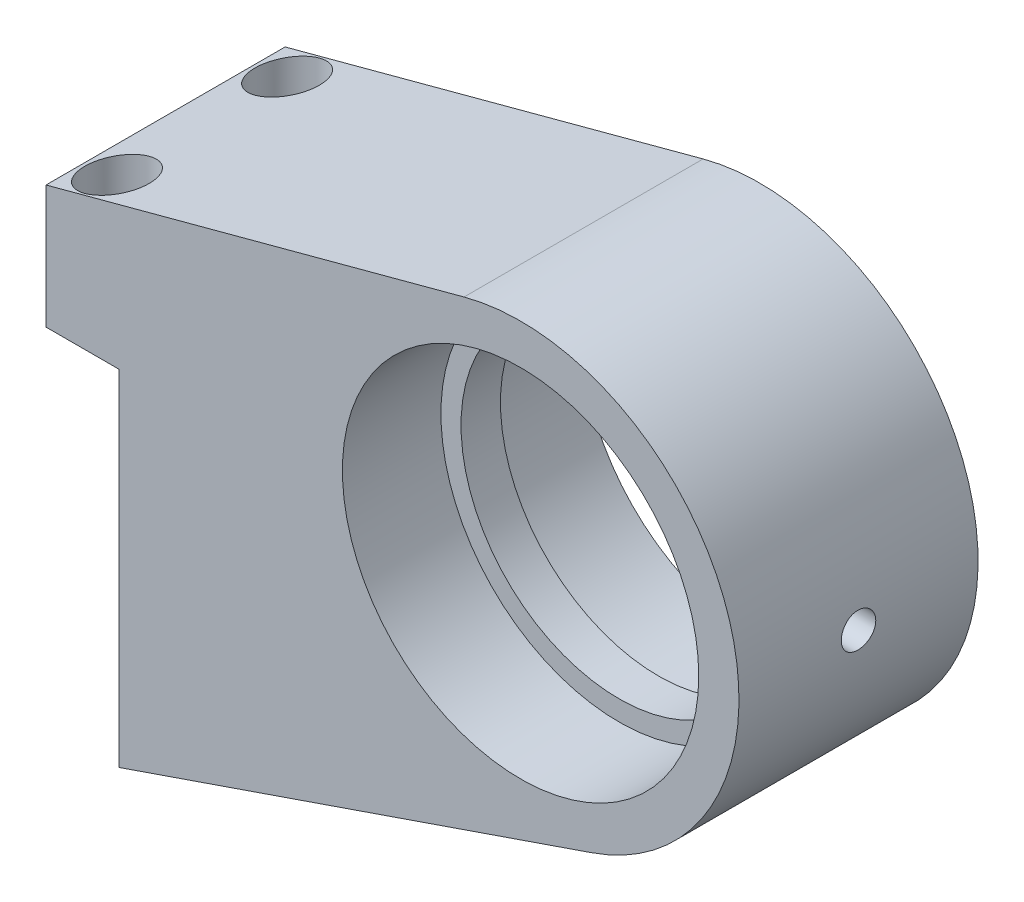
ISO-10303-21;
HEADER;
FILE_DESCRIPTION(('STEP AP214'),'2;1');
FILE_NAME('part.step','',(''),(''),'','','');
FILE_SCHEMA(('AUTOMOTIVE_DESIGN { 1 0 10303 214 1 1 1 1 }'));
ENDSEC;
DATA;
#1=APPLICATION_CONTEXT('core data for automotive mechanical design processes');
#2=APPLICATION_PROTOCOL_DEFINITION('international standard','automotive_design',2000,#1);
#3=PRODUCT_CONTEXT('',#1,'mechanical');
#4=PRODUCT('Part','Part','',(#3));
#5=PRODUCT_RELATED_PRODUCT_CATEGORY('part','',(#4));
#6=PRODUCT_DEFINITION_FORMATION('','',#4);
#7=PRODUCT_DEFINITION_CONTEXT('part definition',#1,'design');
#8=PRODUCT_DEFINITION('design','',#6,#7);
#9=PRODUCT_DEFINITION_SHAPE('','',#8);
#10=(LENGTH_UNIT() NAMED_UNIT(*) SI_UNIT(.MILLI.,.METRE.));
#11=(NAMED_UNIT(*) PLANE_ANGLE_UNIT() SI_UNIT($,.RADIAN.));
#12=(NAMED_UNIT(*) SI_UNIT($,.STERADIAN.) SOLID_ANGLE_UNIT());
#13=UNCERTAINTY_MEASURE_WITH_UNIT(LENGTH_MEASURE(1.E-05),#10,'distance_accuracy_value','');
#14=(GEOMETRIC_REPRESENTATION_CONTEXT(3) GLOBAL_UNCERTAINTY_ASSIGNED_CONTEXT((#13)) GLOBAL_UNIT_ASSIGNED_CONTEXT((#10,
#11,#12)) REPRESENTATION_CONTEXT('',''));
#15=CARTESIAN_POINT('',(0.,0.,0.));
#16=DIRECTION('',(0.,0.,1.));
#17=DIRECTION('',(1.,0.,0.));
#18=AXIS2_PLACEMENT_3D('',#15,#16,#17);
#19=CARTESIAN_POINT('',(-210.619690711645,105.906843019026,41.6));
#20=DIRECTION('',(1.,0.,0.));
#21=DIRECTION('',(0.,0.,-1.));
#22=AXIS2_PLACEMENT_3D('',#19,#20,#21);
#23=PLANE('',#22);
#24=DIRECTION('',(0.,1.,0.));
#25=VECTOR('',#24,1.);
#26=CARTESIAN_POINT('',(-210.619690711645,105.906843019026,0.));
#27=LINE('',#26,#25);
#28=CARTESIAN_POINT('',(-210.619690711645,105.906843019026,0.));
#29=VERTEX_POINT('',#28);
#30=CARTESIAN_POINT('',(-210.619690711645,127.324395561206,0.));
#31=VERTEX_POINT('',#30);
#32=EDGE_CURVE('E60',#29,#31,#27,.T.);
#33=ORIENTED_EDGE('',*,*,#32,.F.);
#34=DIRECTION('',(0.,0.,-1.));
#35=VECTOR('',#34,1.);
#36=CARTESIAN_POINT('',(-210.619690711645,105.906843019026,26.5));
#37=LINE('',#36,#35);
#38=CARTESIAN_POINT('',(-210.619690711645,105.906843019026,41.6));
#39=VERTEX_POINT('',#38);
#40=EDGE_CURVE('E106',#39,#29,#37,.T.);
#41=ORIENTED_EDGE('',*,*,#40,.F.);
#42=DIRECTION('',(0.,-1.,0.));
#43=VECTOR('',#42,1.);
#44=CARTESIAN_POINT('',(-210.619690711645,105.906843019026,41.6));
#45=LINE('',#44,#43);
#46=CARTESIAN_POINT('',(-210.619690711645,127.324395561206,41.6));
#47=VERTEX_POINT('',#46);
#48=EDGE_CURVE('E620',#47,#39,#45,.T.);
#49=ORIENTED_EDGE('',*,*,#48,.F.);
#50=DIRECTION('',(0.,0.,1.));
#51=VECTOR('',#50,1.);
#52=CARTESIAN_POINT('',(-210.619690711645,127.324395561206,41.6));
#53=LINE('',#52,#51);
#54=EDGE_CURVE('E52',#47,#31,#53,.F.);
#55=ORIENTED_EDGE('',*,*,#54,.T.);
#56=EDGE_LOOP('',(#33,#41,#49,#55));
#57=FACE_BOUND('',#56,.T.);
#58=ADVANCED_FACE('F41',(#57),#23,.F.);
#59=CARTESIAN_POINT('',(-197.919690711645,45.9068430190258,41.6));
#60=DIRECTION('',(-0.325094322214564,0.945681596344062,0.));
#61=DIRECTION('',(-0.945681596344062,-0.325094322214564,0.));
#62=AXIS2_PLACEMENT_3D('',#59,#60,#61);
#63=PLANE('',#62);
#64=DIRECTION('',(0.,0.,-1.));
#65=VECTOR('',#64,1.);
#66=CARTESIAN_POINT('',(-115.696768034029,74.1723875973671,41.6));
#67=LINE('',#66,#65);
#68=CARTESIAN_POINT('',(-115.696768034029,74.1723875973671,41.6));
#69=VERTEX_POINT('',#68);
#70=CARTESIAN_POINT('',(-115.696768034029,74.1723875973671,0.));
#71=VERTEX_POINT('',#70);
#72=EDGE_CURVE('E114',#69,#71,#67,.T.);
#73=ORIENTED_EDGE('',*,*,#72,.F.);
#74=DIRECTION('',(0.945681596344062,0.325094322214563,0.));
#75=VECTOR('',#74,1.);
#76=CARTESIAN_POINT('',(-115.696768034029,74.1723875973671,41.6));
#77=LINE('',#76,#75);
#78=CARTESIAN_POINT('',(-197.919690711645,45.9068430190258,41.6));
#79=VERTEX_POINT('',#78);
#80=EDGE_CURVE('E525',#79,#69,#77,.T.);
#81=ORIENTED_EDGE('',*,*,#80,.F.);
#82=DIRECTION('',(0.,0.,-1.));
#83=VECTOR('',#82,1.);
#84=CARTESIAN_POINT('',(-197.919690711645,45.9068430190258,41.6));
#85=LINE('',#84,#83);
#86=CARTESIAN_POINT('',(-197.919690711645,45.9068430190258,26.5));
#87=VERTEX_POINT('',#86);
#88=EDGE_CURVE('E523',#79,#87,#85,.T.);
#89=ORIENTED_EDGE('',*,*,#88,.T.);
#90=CARTESIAN_POINT('',(-197.919690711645,45.9068430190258,23.5));
#91=DIRECTION('',(-0.325094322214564,0.945681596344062,0.));
#92=DIRECTION('',(-0.945681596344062,-0.325094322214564,0.));
#93=AXIS2_PLACEMENT_3D('',#90,#91,#92);
#94=ELLIPSE('',#93,9.22809103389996,3.);
#95=CARTESIAN_POINT('',(-189.70036271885,48.7323784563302,24.5081416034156));
#96=VERTEX_POINT('',#95);
#97=EDGE_CURVE('E170',#96,#87,#94,.F.);
#98=ORIENTED_EDGE('',*,*,#97,.F.);
#99=CARTESIAN_POINT('',(-176.00148273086,53.4416041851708,26.1883776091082));
#100=DIRECTION('',(-0.325094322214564,0.945681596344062,0.));
#101=DIRECTION('',(-0.945681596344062,-0.325094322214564,0.));
#102=AXIS2_PLACEMENT_3D('',#99,#100,#101);
#103=ELLIPSE('',#102,15.3801517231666,5.);
#104=CARTESIAN_POINT('',(-179.654517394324,52.1858106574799,21.3486480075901));
#105=VERTEX_POINT('',#104);
#106=EDGE_CURVE('E166',#105,#96,#103,.T.);
#107=ORIENTED_EDGE('',*,*,#106,.F.);
#108=CARTESIAN_POINT('',(-197.919690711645,45.9068430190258,-2.84999999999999));
#109=DIRECTION('',(-0.325094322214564,0.945681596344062,0.));
#110=DIRECTION('',(-0.945681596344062,-0.325094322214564,0.));
#111=AXIS2_PLACEMENT_3D('',#108,#109,#110);
#112=ELLIPSE('',#111,76.900758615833,25.);
#113=CARTESIAN_POINT('',(-125.670162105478,70.7438617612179,0.));
#114=VERTEX_POINT('',#113);
#115=EDGE_CURVE('E171',#114,#105,#112,.F.);
#116=ORIENTED_EDGE('',*,*,#115,.F.);
#117=DIRECTION('',(-0.945681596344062,-0.325094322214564,0.));
#118=VECTOR('',#117,1.);
#119=CARTESIAN_POINT('',(-197.919690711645,45.9068430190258,0.));
#120=LINE('',#119,#118);
#121=EDGE_CURVE('E135',#71,#114,#120,.T.);
#122=ORIENTED_EDGE('',*,*,#121,.F.);
#123=EDGE_LOOP('',(#73,#81,#89,#98,#107,#116,#122));
#124=FACE_BOUND('',#123,.T.);
#125=ADVANCED_FACE('F356',(#124),#63,.F.);
#126=CARTESIAN_POINT('',(-128.050352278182,110.108288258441,41.6));
#127=DIRECTION('',(0.,0.,-1.));
#128=DIRECTION('',(-1.,0.,0.));
#129=AXIS2_PLACEMENT_3D('',#126,#127,#128);
#130=CYLINDRICAL_SURFACE('',#129,38.);
#131=CARTESIAN_POINT('',(-90.0503676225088,110.074139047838,17.8));
#132=CARTESIAN_POINT('',(-90.0502180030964,110.242361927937,17.8000073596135));
#133=CARTESIAN_POINT('',(-90.0511941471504,110.41070106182,17.8141970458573));
#134=CARTESIAN_POINT('',(-90.0552848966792,110.742725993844,17.8705958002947));
#135=CARTESIAN_POINT('',(-90.0584019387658,110.906406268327,17.9128367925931));
#136=CARTESIAN_POINT('',(-90.0664099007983,111.224256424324,18.0241117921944));
#137=CARTESIAN_POINT('',(-90.0712998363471,111.378431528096,18.0931309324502));
#138=CARTESIAN_POINT('',(-90.0822931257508,111.672971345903,18.2559770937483));
#139=CARTESIAN_POINT('',(-90.0883962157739,111.813339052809,18.3497987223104));
#140=CARTESIAN_POINT('',(-90.1011356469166,112.076636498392,18.5598174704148));
#141=CARTESIAN_POINT('',(-90.1077730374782,112.199530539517,18.6760592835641));
#142=CARTESIAN_POINT('',(-90.1208154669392,112.424086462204,18.9275246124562));
#143=CARTESIAN_POINT('',(-90.127220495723,112.525747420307,19.0627489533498));
#144=CARTESIAN_POINT('',(-90.1390766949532,112.705074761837,19.3485607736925));
#145=CARTESIAN_POINT('',(-90.1445265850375,112.782709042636,19.4991684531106));
#146=CARTESIAN_POINT('',(-90.1538381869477,112.91157532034,19.8113306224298));
#147=CARTESIAN_POINT('',(-90.157699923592,112.962807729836,19.9728849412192));
#148=CARTESIAN_POINT('',(-90.1633860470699,113.037315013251,20.3020058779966));
#149=CARTESIAN_POINT('',(-90.1652145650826,113.060646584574,20.4695595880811));
#150=CARTESIAN_POINT('',(-90.1666385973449,113.078864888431,20.8062142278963));
#151=CARTESIAN_POINT('',(-90.1662341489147,113.073752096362,20.9753151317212));
#152=CARTESIAN_POINT('',(-90.1632421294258,113.035274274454,21.309871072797));
#153=CARTESIAN_POINT('',(-90.1606593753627,113.001971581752,21.4753333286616));
#154=CARTESIAN_POINT('',(-90.1536118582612,112.908156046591,21.7983123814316));
#155=CARTESIAN_POINT('',(-90.1491470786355,112.847642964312,21.9558291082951));
#156=CARTESIAN_POINT('',(-90.1388376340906,112.701054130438,22.2586449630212));
#157=CARTESIAN_POINT('',(-90.1329914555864,112.614950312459,22.4039304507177));
#158=CARTESIAN_POINT('',(-90.1205859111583,112.419644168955,22.6780104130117));
#159=CARTESIAN_POINT('',(-90.1140265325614,112.310441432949,22.8068045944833));
#160=CARTESIAN_POINT('',(-90.100920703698,112.071688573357,23.0446067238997));
#161=CARTESIAN_POINT('',(-90.094374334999,111.942084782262,23.1535608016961));
#162=CARTESIAN_POINT('',(-90.0820588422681,111.666396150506,23.3481732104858));
#163=CARTESIAN_POINT('',(-90.0762897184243,111.520311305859,23.4338315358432));
#164=CARTESIAN_POINT('',(-90.0661891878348,111.215780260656,23.5794134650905));
#165=CARTESIAN_POINT('',(-90.0618578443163,111.057333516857,23.6393359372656));
#166=CARTESIAN_POINT('',(-90.0551340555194,110.732586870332,23.7317134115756));
#167=CARTESIAN_POINT('',(-90.0527415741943,110.566287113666,23.7641689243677));
#168=CARTESIAN_POINT('',(-90.0501818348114,110.231031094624,23.8006233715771));
#169=CARTESIAN_POINT('',(-90.0500086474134,110.062083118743,23.8046981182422));
#170=CARTESIAN_POINT('',(-90.051904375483,109.725907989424,23.784474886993));
#171=CARTESIAN_POINT('',(-90.0539732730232,109.558680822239,23.7601771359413));
#172=CARTESIAN_POINT('',(-90.0601292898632,109.230899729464,23.6839601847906));
#173=CARTESIAN_POINT('',(-90.0642139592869,109.070337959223,23.6320745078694));
#174=CARTESIAN_POINT('',(-90.0739549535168,108.760200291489,23.5021898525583));
#175=CARTESIAN_POINT('',(-90.0796113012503,108.610624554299,23.4241904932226));
#176=CARTESIAN_POINT('',(-90.091888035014,108.326349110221,23.2440956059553));
#177=CARTESIAN_POINT('',(-90.0985104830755,108.191682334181,23.1419482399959));
#178=CARTESIAN_POINT('',(-90.1119778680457,107.941380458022,22.9165320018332));
#179=CARTESIAN_POINT('',(-90.1188228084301,107.825745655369,22.7932627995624));
#180=CARTESIAN_POINT('',(-90.1319901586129,107.616530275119,22.5287720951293));
#181=CARTESIAN_POINT('',(-90.1383113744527,107.522999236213,22.3875113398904));
#182=CARTESIAN_POINT('',(-90.1497064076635,107.360986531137,22.0912429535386));
#183=CARTESIAN_POINT('',(-90.1547802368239,107.292504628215,21.9362354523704));
#184=CARTESIAN_POINT('',(-90.1631045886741,107.182623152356,21.6170606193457));
#185=CARTESIAN_POINT('',(-90.1663572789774,107.141191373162,21.4529044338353));
#186=CARTESIAN_POINT('',(-90.1706816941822,107.086480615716,21.1199384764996));
#187=CARTESIAN_POINT('',(-90.1717534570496,107.073201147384,20.951128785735));
#188=CARTESIAN_POINT('',(-90.1715951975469,107.07517738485,20.6141516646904));
#189=CARTESIAN_POINT('',(-90.1703716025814,107.090353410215,20.4459837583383));
#190=CARTESIAN_POINT('',(-90.1657729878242,107.148643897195,20.1145930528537));
#191=CARTESIAN_POINT('',(-90.1623979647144,107.191758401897,19.9513702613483));
#192=CARTESIAN_POINT('',(-90.1538751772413,107.304682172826,19.6344965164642));
#193=CARTESIAN_POINT('',(-90.1487274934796,107.374490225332,19.4808451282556));
#194=CARTESIAN_POINT('',(-90.1372340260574,107.538810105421,19.1874304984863));
#195=CARTESIAN_POINT('',(-90.1308882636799,107.63332149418,19.0476670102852));
#196=CARTESIAN_POINT('',(-90.1176854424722,107.844663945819,18.7855881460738));
#197=CARTESIAN_POINT('',(-90.1108270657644,107.961553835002,18.6633202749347));
#198=CARTESIAN_POINT('',(-90.097374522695,108.214231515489,18.4400919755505));
#199=CARTESIAN_POINT('',(-90.0907804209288,108.35002389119,18.3391367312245));
#200=CARTESIAN_POINT('',(-90.0785779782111,108.636897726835,18.1612725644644));
#201=CARTESIAN_POINT('',(-90.0729714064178,108.78800587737,18.0844066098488));
#202=CARTESIAN_POINT('',(-90.0633858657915,109.100923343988,17.9572354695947));
#203=CARTESIAN_POINT('',(-90.0594050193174,109.262720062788,17.9068996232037));
#204=CARTESIAN_POINT('',(-90.0545492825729,109.53358928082,17.8470965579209));
#205=CARTESIAN_POINT('',(-90.0530731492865,109.640917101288,17.8294587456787));
#206=CARTESIAN_POINT('',(-90.0510306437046,109.856860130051,17.8059081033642));
#207=CARTESIAN_POINT('',(-90.0504642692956,109.965475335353,17.7999952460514));
#208=CARTESIAN_POINT('',(-90.0503676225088,110.074139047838,17.8));
#209=B_SPLINE_CURVE_WITH_KNOTS('',3,(#131,#132,#133,#134,#135,#136,#137,#138,#139,#140,#141,
#142,#143,#144,#145,#146,#147,#148,#149,#150,#151,#152,#153,#154,#155,#156,#157,#158,#159,#160,
#161,#162,#163,#164,#165,#166,#167,#168,#169,#170,#171,#172,#173,#174,#175,#176,#177,#178,#179,
#180,#181,#182,#183,#184,#185,#186,#187,#188,#189,#190,#191,#192,#193,#194,#195,#196,#197,#198,
#199,#200,#201,#202,#203,#204,#205,#206,#207,#208),.UNSPECIFIED.,.T.,.F.,(4,2,2,2,2,2,2,2,2,2,2,
2,2,2,2,2,2,2,2,2,2,2,2,2,2,2,2,2,2,2,2,2,2,2,2,2,2,2,4),(0.,0.504272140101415,1.00911915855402,
1.51368628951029,2.01814380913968,2.5236175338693,3.02911323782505,3.53528145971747,
4.04144177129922,4.54657175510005,5.05169329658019,5.55570075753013,6.05971266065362,
6.56427938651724,7.06885507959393,7.57478101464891,8.08070707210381,8.58665537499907,
9.09259427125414,9.59718115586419,10.1017640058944,10.6057351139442,11.1097135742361,
11.6147838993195,12.1198621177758,12.6260617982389,13.1322566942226,13.6378478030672,
14.1434301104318,14.6475988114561,15.1517682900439,15.6559148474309,16.1600524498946,
16.6655339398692,17.1711382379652,17.6776393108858,18.1835537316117,18.5092895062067,
18.8350245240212),.UNSPECIFIED.);
#210=CARTESIAN_POINT('',(-90.0503676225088,110.074139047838,17.8));
#211=VERTEX_POINT('',#210);
#212=EDGE_CURVE('E362',#211,#211,#209,.T.);
#213=ORIENTED_EDGE('',*,*,#212,.F.);
#214=EDGE_LOOP('',(#213));
#215=FACE_BOUND('',#214,.T.);
#216=DIRECTION('',(0.,0.,1.));
#217=VECTOR('',#216,1.);
#218=CARTESIAN_POINT('',(-137.885475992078,146.813469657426,41.6));
#219=LINE('',#218,#217);
#220=CARTESIAN_POINT('',(-137.885475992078,146.813469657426,0.));
#221=VERTEX_POINT('',#220);
#222=CARTESIAN_POINT('',(-137.885475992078,146.813469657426,41.6));
#223=VERTEX_POINT('',#222);
#224=EDGE_CURVE('E225',#221,#223,#219,.T.);
#225=ORIENTED_EDGE('',*,*,#224,.T.);
#226=CARTESIAN_POINT('',(-128.050352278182,110.108288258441,41.6));
#227=DIRECTION('',(0.,0.,1.));
#228=DIRECTION('',(-1.,0.,0.));
#229=AXIS2_PLACEMENT_3D('',#226,#227,#228);
#230=CIRCLE('',#229,38.);
#231=EDGE_CURVE('E614',#69,#223,#230,.T.);
#232=ORIENTED_EDGE('',*,*,#231,.F.);
#233=ORIENTED_EDGE('',*,*,#72,.T.);
#234=CARTESIAN_POINT('',(-128.050352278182,110.108288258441,0.));
#235=DIRECTION('',(0.,0.,-1.));
#236=DIRECTION('',(-1.,0.,0.));
#237=AXIS2_PLACEMENT_3D('',#234,#235,#236);
#238=CIRCLE('',#237,38.);
#239=EDGE_CURVE('E150',#71,#221,#238,.F.);
#240=ORIENTED_EDGE('',*,*,#239,.T.);
#241=EDGE_LOOP('',(#225,#232,#233,#240));
#242=FACE_BOUND('',#241,.T.);
#243=ADVANCED_FACE('F350',(#215,#242),#130,.T.);
#244=CARTESIAN_POINT('',(-210.619690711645,127.324395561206,41.6));
#245=DIRECTION('',(0.258819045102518,-0.965925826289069,0.));
#246=DIRECTION('',(0.965925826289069,0.258819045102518,0.));
#247=AXIS2_PLACEMENT_3D('',#244,#245,#246);
#248=PLANE('',#247);
#249=CARTESIAN_POINT('',(-204.269690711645,129.025872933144,6.));
#250=DIRECTION('',(0.258819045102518,-0.965925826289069,0.));
#251=DIRECTION('',(0.965925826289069,0.258819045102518,0.));
#252=AXIS2_PLACEMENT_3D('',#249,#250,#251);
#253=ELLIPSE('',#252,5.79754661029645,5.59999999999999);
#254=CARTESIAN_POINT('',(-198.669690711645,130.526388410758,6.));
#255=VERTEX_POINT('',#254);
#256=EDGE_CURVE('E542',#255,#255,#253,.T.);
#257=ORIENTED_EDGE('',*,*,#256,.T.);
#258=EDGE_LOOP('',(#257));
#259=FACE_BOUND('',#258,.T.);
#260=CARTESIAN_POINT('',(-204.269690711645,129.025872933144,35.6));
#261=DIRECTION('',(0.258819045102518,-0.965925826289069,0.));
#262=DIRECTION('',(0.965925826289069,0.258819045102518,0.));
#263=AXIS2_PLACEMENT_3D('',#260,#261,#262);
#264=ELLIPSE('',#263,5.79754661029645,5.59999999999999);
#265=CARTESIAN_POINT('',(-198.669690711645,130.526388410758,35.6));
#266=VERTEX_POINT('',#265);
#267=EDGE_CURVE('E538',#266,#266,#264,.T.);
#268=ORIENTED_EDGE('',*,*,#267,.T.);
#269=EDGE_LOOP('',(#268));
#270=FACE_BOUND('',#269,.T.);
#271=ORIENTED_EDGE('',*,*,#54,.F.);
#272=DIRECTION('',(-0.965925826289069,-0.258819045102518,0.));
#273=VECTOR('',#272,1.);
#274=CARTESIAN_POINT('',(-210.619690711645,127.324395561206,41.6));
#275=LINE('',#274,#273);
#276=EDGE_CURVE('E617',#223,#47,#275,.T.);
#277=ORIENTED_EDGE('',*,*,#276,.F.);
#278=ORIENTED_EDGE('',*,*,#224,.F.);
#279=DIRECTION('',(0.965925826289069,0.258819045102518,0.));
#280=VECTOR('',#279,1.);
#281=CARTESIAN_POINT('',(-210.619690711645,127.324395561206,0.));
#282=LINE('',#281,#280);
#283=EDGE_CURVE('E13',#31,#221,#282,.T.);
#284=ORIENTED_EDGE('',*,*,#283,.F.);
#285=EDGE_LOOP('',(#271,#277,#278,#284));
#286=FACE_BOUND('',#285,.T.);
#287=ADVANCED_FACE('F355',(#259,#270,#286),#248,.F.);
#288=CARTESIAN_POINT('',(-90.0503522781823,45.9068430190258,-2.84999999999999));
#289=DIRECTION('',(-1.,0.,0.));
#290=DIRECTION('',(0.,0.,1.));
#291=AXIS2_PLACEMENT_3D('',#288,#289,#290);
#292=CYLINDRICAL_SURFACE('',#291,25.);
#293=DIRECTION('',(-1.,0.,0.));
#294=VECTOR('',#293,1.);
#295=CARTESIAN_POINT('',(-90.0503522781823,52.1858106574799,21.3486480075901));
#296=LINE('',#295,#294);
#297=CARTESIAN_POINT('',(-197.919690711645,52.1858106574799,21.3486480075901));
#298=VERTEX_POINT('',#297);
#299=EDGE_CURVE('E131',#298,#105,#296,.F.);
#300=ORIENTED_EDGE('',*,*,#299,.F.);
#301=CARTESIAN_POINT('',(-197.919690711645,45.9068430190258,-2.84999999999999));
#302=DIRECTION('',(1.,0.,0.));
#303=DIRECTION('',(0.,0.,-1.));
#304=AXIS2_PLACEMENT_3D('',#301,#302,#303);
#305=CIRCLE('',#304,25.);
#306=CARTESIAN_POINT('',(-197.919690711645,70.7438617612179,0.));
#307=VERTEX_POINT('',#306);
#308=EDGE_CURVE('E125',#307,#298,#305,.T.);
#309=ORIENTED_EDGE('',*,*,#308,.F.);
#310=DIRECTION('',(1.,0.,0.));
#311=VECTOR('',#310,1.);
#312=CARTESIAN_POINT('',(-128.050352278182,70.7438617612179,0.));
#313=LINE('',#312,#311);
#314=EDGE_CURVE('E79',#307,#114,#313,.T.);
#315=ORIENTED_EDGE('',*,*,#314,.T.);
#316=ORIENTED_EDGE('',*,*,#115,.T.);
#317=EDGE_LOOP('',(#300,#309,#315,#316));
#318=FACE_BOUND('',#317,.T.);
#319=ADVANCED_FACE('F43',(#318),#292,.F.);
#320=CARTESIAN_POINT('',(-90.0503522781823,53.4416041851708,26.1883776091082));
#321=DIRECTION('',(-1.,0.,0.));
#322=DIRECTION('',(0.,0.,1.));
#323=AXIS2_PLACEMENT_3D('',#320,#321,#322);
#324=CYLINDRICAL_SURFACE('',#323,5.);
#325=CARTESIAN_POINT('',(-197.919690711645,53.4416041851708,26.1883776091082));
#326=DIRECTION('',(-1.,0.,0.));
#327=DIRECTION('',(0.,0.,1.));
#328=AXIS2_PLACEMENT_3D('',#325,#326,#327);
#329=CIRCLE('',#328,5.00000000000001);
#330=CARTESIAN_POINT('',(-197.919690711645,48.7323784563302,24.5081416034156));
#331=VERTEX_POINT('',#330);
#332=EDGE_CURVE('E94',#298,#331,#329,.T.);
#333=ORIENTED_EDGE('',*,*,#332,.F.);
#334=ORIENTED_EDGE('',*,*,#299,.T.);
#335=ORIENTED_EDGE('',*,*,#106,.T.);
#336=DIRECTION('',(-1.,0.,0.));
#337=VECTOR('',#336,1.);
#338=CARTESIAN_POINT('',(-90.0503522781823,48.7323784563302,24.5081416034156));
#339=LINE('',#338,#337);
#340=EDGE_CURVE('E138',#96,#331,#339,.T.);
#341=ORIENTED_EDGE('',*,*,#340,.T.);
#342=EDGE_LOOP('',(#333,#334,#335,#341));
#343=FACE_BOUND('',#342,.T.);
#344=ADVANCED_FACE('F508',(#343),#324,.T.);
#345=CARTESIAN_POINT('',(-90.0503522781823,45.9068430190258,23.5));
#346=DIRECTION('',(-1.,0.,0.));
#347=DIRECTION('',(0.,0.,1.));
#348=AXIS2_PLACEMENT_3D('',#345,#346,#347);
#349=CYLINDRICAL_SURFACE('',#348,3.);
#350=ORIENTED_EDGE('',*,*,#97,.T.);
#351=CARTESIAN_POINT('',(-197.919690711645,45.9068430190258,23.5));
#352=DIRECTION('',(1.,0.,0.));
#353=DIRECTION('',(0.,0.,-1.));
#354=AXIS2_PLACEMENT_3D('',#351,#352,#353);
#355=CIRCLE('',#354,3.);
#356=EDGE_CURVE('E88',#331,#87,#355,.T.);
#357=ORIENTED_EDGE('',*,*,#356,.F.);
#358=ORIENTED_EDGE('',*,*,#340,.F.);
#359=EDGE_LOOP('',(#350,#357,#358));
#360=FACE_BOUND('',#359,.T.);
#361=ADVANCED_FACE('F502',(#360),#349,.F.);
#362=CARTESIAN_POINT('',(-128.050352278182,110.108288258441,0.));
#363=DIRECTION('',(0.,0.,1.));
#364=DIRECTION('',(1.,0.,0.));
#365=AXIS2_PLACEMENT_3D('',#362,#363,#364);
#366=PLANE('',#365);
#367=CARTESIAN_POINT('',(-190.410297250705,84.4801271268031,0.));
#368=DIRECTION('',(0.,0.,-1.));
#369=DIRECTION('',(-1.,0.,0.));
#370=AXIS2_PLACEMENT_3D('',#367,#368,#369);
#371=CIRCLE('',#370,1.25);
#372=CARTESIAN_POINT('',(-191.660297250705,84.4801271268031,0.));
#373=VERTEX_POINT('',#372);
#374=EDGE_CURVE('E369',#373,#373,#371,.T.);
#375=ORIENTED_EDGE('',*,*,#374,.F.);
#376=EDGE_LOOP('',(#375));
#377=FACE_BOUND('',#376,.T.);
#378=CARTESIAN_POINT('',(-180.210297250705,106.730127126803,0.));
#379=DIRECTION('',(0.,0.,-1.));
#380=DIRECTION('',(-1.,0.,0.));
#381=AXIS2_PLACEMENT_3D('',#378,#379,#380);
#382=CIRCLE('',#381,1.25);
#383=CARTESIAN_POINT('',(-181.460297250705,106.730127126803,0.));
#384=VERTEX_POINT('',#383);
#385=EDGE_CURVE('E967',#384,#384,#382,.T.);
#386=ORIENTED_EDGE('',*,*,#385,.F.);
#387=EDGE_LOOP('',(#386));
#388=FACE_BOUND('',#387,.T.);
#389=CARTESIAN_POINT('',(-128.050352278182,110.108288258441,0.));
#390=DIRECTION('',(0.,0.,1.));
#391=DIRECTION('',(1.,0.,0.));
#392=AXIS2_PLACEMENT_3D('',#389,#390,#391);
#393=CIRCLE('',#392,31.);
#394=CARTESIAN_POINT('',(-97.0503522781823,110.108288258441,0.));
#395=VERTEX_POINT('',#394);
#396=EDGE_CURVE('E611',#395,#395,#393,.T.);
#397=ORIENTED_EDGE('',*,*,#396,.T.);
#398=EDGE_LOOP('',(#397));
#399=FACE_BOUND('',#398,.T.);
#400=DIRECTION('',(0.,-1.,0.));
#401=VECTOR('',#400,1.);
#402=CARTESIAN_POINT('',(-197.919690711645,105.906843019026,0.));
#403=LINE('',#402,#401);
#404=CARTESIAN_POINT('',(-197.919690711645,105.906843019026,0.));
#405=VERTEX_POINT('',#404);
#406=EDGE_CURVE('E123',#405,#307,#403,.T.);
#407=ORIENTED_EDGE('',*,*,#406,.F.);
#408=DIRECTION('',(-1.,0.,0.));
#409=VECTOR('',#408,1.);
#410=CARTESIAN_POINT('',(-197.919690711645,105.906843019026,0.));
#411=LINE('',#410,#409);
#412=EDGE_CURVE('E237',#405,#29,#411,.T.);
#413=ORIENTED_EDGE('',*,*,#412,.T.);
#414=ORIENTED_EDGE('',*,*,#32,.T.);
#415=ORIENTED_EDGE('',*,*,#283,.T.);
#416=ORIENTED_EDGE('',*,*,#239,.F.);
#417=ORIENTED_EDGE('',*,*,#121,.T.);
#418=ORIENTED_EDGE('',*,*,#314,.F.);
#419=EDGE_LOOP('',(#407,#413,#414,#415,#416,#417,#418));
#420=FACE_BOUND('',#419,.T.);
#421=ADVANCED_FACE('F133',(#377,#388,#399,#420),#366,.F.);
#422=CARTESIAN_POINT('',(-197.919690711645,105.906843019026,26.5));
#423=DIRECTION('',(0.,1.,0.));
#424=DIRECTION('',(0.,0.,1.));
#425=AXIS2_PLACEMENT_3D('',#422,#423,#424);
#426=PLANE('',#425);
#427=CARTESIAN_POINT('',(-204.269690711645,105.906843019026,6.));
#428=DIRECTION('',(0.,1.,0.));
#429=DIRECTION('',(0.,0.,1.));
#430=AXIS2_PLACEMENT_3D('',#427,#428,#429);
#431=CIRCLE('',#430,3.30000000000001);
#432=CARTESIAN_POINT('',(-204.269690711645,105.906843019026,9.30000000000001));
#433=VERTEX_POINT('',#432);
#434=EDGE_CURVE('E45',#433,#433,#431,.T.);
#435=ORIENTED_EDGE('',*,*,#434,.T.);
#436=EDGE_LOOP('',(#435));
#437=FACE_BOUND('',#436,.T.);
#438=CARTESIAN_POINT('',(-204.269690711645,105.906843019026,35.6));
#439=DIRECTION('',(0.,1.,0.));
#440=DIRECTION('',(0.,0.,1.));
#441=AXIS2_PLACEMENT_3D('',#438,#439,#440);
#442=CIRCLE('',#441,3.30000000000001);
#443=CARTESIAN_POINT('',(-204.269690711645,105.906843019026,38.9));
#444=VERTEX_POINT('',#443);
#445=EDGE_CURVE('E535',#444,#444,#442,.T.);
#446=ORIENTED_EDGE('',*,*,#445,.T.);
#447=EDGE_LOOP('',(#446));
#448=FACE_BOUND('',#447,.T.);
#449=ORIENTED_EDGE('',*,*,#40,.T.);
#450=ORIENTED_EDGE('',*,*,#412,.F.);
#451=DIRECTION('',(0.,0.,-1.));
#452=VECTOR('',#451,1.);
#453=CARTESIAN_POINT('',(-197.919690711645,105.906843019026,26.5));
#454=LINE('',#453,#452);
#455=CARTESIAN_POINT('',(-197.919690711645,105.906843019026,41.6));
#456=VERTEX_POINT('',#455);
#457=EDGE_CURVE('E128',#456,#405,#454,.T.);
#458=ORIENTED_EDGE('',*,*,#457,.F.);
#459=DIRECTION('',(1.,0.,0.));
#460=VECTOR('',#459,1.);
#461=CARTESIAN_POINT('',(-197.919690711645,105.906843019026,41.6));
#462=LINE('',#461,#460);
#463=EDGE_CURVE('E623',#39,#456,#462,.T.);
#464=ORIENTED_EDGE('',*,*,#463,.F.);
#465=EDGE_LOOP('',(#449,#450,#458,#464));
#466=FACE_BOUND('',#465,.T.);
#467=ADVANCED_FACE('F495',(#437,#448,#466),#426,.F.);
#468=CARTESIAN_POINT('',(-197.919690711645,45.9068430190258,23.5));
#469=DIRECTION('',(1.,0.,0.));
#470=DIRECTION('',(0.,0.,-1.));
#471=AXIS2_PLACEMENT_3D('',#468,#469,#470);
#472=PLANE('',#471);
#473=CARTESIAN_POINT('',(-197.919690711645,67.9068430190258,20.8));
#474=DIRECTION('',(-1.,0.,0.));
#475=DIRECTION('',(0.,0.,1.));
#476=AXIS2_PLACEMENT_3D('',#473,#474,#475);
#477=CIRCLE('',#476,2.49999999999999);
#478=CARTESIAN_POINT('',(-197.919690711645,67.9068430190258,23.3));
#479=VERTEX_POINT('',#478);
#480=EDGE_CURVE('E541',#479,#479,#477,.T.);
#481=ORIENTED_EDGE('',*,*,#480,.F.);
#482=EDGE_LOOP('',(#481));
#483=FACE_BOUND('',#482,.T.);
#484=CARTESIAN_POINT('',(-197.919690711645,51.9068430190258,35.6));
#485=DIRECTION('',(-1.,0.,0.));
#486=DIRECTION('',(0.,0.,1.));
#487=AXIS2_PLACEMENT_3D('',#484,#485,#486);
#488=CIRCLE('',#487,2.49999999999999);
#489=CARTESIAN_POINT('',(-197.919690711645,51.9068430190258,38.1));
#490=VERTEX_POINT('',#489);
#491=EDGE_CURVE('E566',#490,#490,#488,.T.);
#492=ORIENTED_EDGE('',*,*,#491,.F.);
#493=EDGE_LOOP('',(#492));
#494=FACE_BOUND('',#493,.T.);
#495=CARTESIAN_POINT('',(-197.919690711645,75.9068430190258,35.6));
#496=DIRECTION('',(-1.,0.,0.));
#497=DIRECTION('',(0.,0.,1.));
#498=AXIS2_PLACEMENT_3D('',#495,#496,#497);
#499=CIRCLE('',#498,2.49999999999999);
#500=CARTESIAN_POINT('',(-197.919690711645,75.9068430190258,38.1));
#501=VERTEX_POINT('',#500);
#502=EDGE_CURVE('E572',#501,#501,#499,.T.);
#503=ORIENTED_EDGE('',*,*,#502,.F.);
#504=EDGE_LOOP('',(#503));
#505=FACE_BOUND('',#504,.T.);
#506=CARTESIAN_POINT('',(-197.919690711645,75.9068430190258,6.));
#507=DIRECTION('',(-1.,0.,0.));
#508=DIRECTION('',(0.,0.,1.));
#509=AXIS2_PLACEMENT_3D('',#506,#507,#508);
#510=CIRCLE('',#509,2.49999999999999);
#511=CARTESIAN_POINT('',(-197.919690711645,75.9068430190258,8.49999999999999));
#512=VERTEX_POINT('',#511);
#513=EDGE_CURVE('E578',#512,#512,#510,.T.);
#514=ORIENTED_EDGE('',*,*,#513,.F.);
#515=EDGE_LOOP('',(#514));
#516=FACE_BOUND('',#515,.T.);
#517=CARTESIAN_POINT('',(-197.919690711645,83.9068430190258,20.8));
#518=DIRECTION('',(-1.,0.,0.));
#519=DIRECTION('',(0.,0.,1.));
#520=AXIS2_PLACEMENT_3D('',#517,#518,#519);
#521=CIRCLE('',#520,2.49999999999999);
#522=CARTESIAN_POINT('',(-197.919690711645,83.9068430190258,23.3));
#523=VERTEX_POINT('',#522);
#524=EDGE_CURVE('E584',#523,#523,#521,.T.);
#525=ORIENTED_EDGE('',*,*,#524,.F.);
#526=EDGE_LOOP('',(#525));
#527=FACE_BOUND('',#526,.T.);
#528=CARTESIAN_POINT('',(-197.919690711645,99.9068430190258,20.8));
#529=DIRECTION('',(-1.,0.,0.));
#530=DIRECTION('',(0.,0.,1.));
#531=AXIS2_PLACEMENT_3D('',#528,#529,#530);
#532=CIRCLE('',#531,2.49999999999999);
#533=CARTESIAN_POINT('',(-197.919690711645,99.9068430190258,23.3));
#534=VERTEX_POINT('',#533);
#535=EDGE_CURVE('E590',#534,#534,#532,.T.);
#536=ORIENTED_EDGE('',*,*,#535,.F.);
#537=EDGE_LOOP('',(#536));
#538=FACE_BOUND('',#537,.T.);
#539=ORIENTED_EDGE('',*,*,#356,.T.);
#540=ORIENTED_EDGE('',*,*,#88,.F.);
#541=DIRECTION('',(0.,-1.,0.));
#542=VECTOR('',#541,1.);
#543=CARTESIAN_POINT('',(-197.919690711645,45.9068430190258,41.6));
#544=LINE('',#543,#542);
#545=EDGE_CURVE('E528',#456,#79,#544,.T.);
#546=ORIENTED_EDGE('',*,*,#545,.F.);
#547=ORIENTED_EDGE('',*,*,#457,.T.);
#548=ORIENTED_EDGE('',*,*,#406,.T.);
#549=ORIENTED_EDGE('',*,*,#308,.T.);
#550=ORIENTED_EDGE('',*,*,#332,.T.);
#551=EDGE_LOOP('',(#539,#540,#546,#547,#548,#549,#550));
#552=FACE_BOUND('',#551,.T.);
#553=ADVANCED_FACE('F124',(#483,#494,#505,#516,#527,#538,#552),#472,.F.);
#554=CARTESIAN_POINT('',(-128.050352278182,110.108288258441,41.6));
#555=DIRECTION('',(0.,0.,-1.));
#556=DIRECTION('',(-1.,0.,0.));
#557=AXIS2_PLACEMENT_3D('',#554,#555,#556);
#558=PLANE('',#557);
#559=CARTESIAN_POINT('',(-128.050352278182,110.108288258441,41.6));
#560=DIRECTION('',(0.,0.,1.));
#561=DIRECTION('',(1.,0.,0.));
#562=AXIS2_PLACEMENT_3D('',#559,#560,#561);
#563=CIRCLE('',#562,31.);
#564=CARTESIAN_POINT('',(-97.0503522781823,110.108288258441,41.6));
#565=VERTEX_POINT('',#564);
#566=EDGE_CURVE('E608',#565,#565,#563,.T.);
#567=ORIENTED_EDGE('',*,*,#566,.F.);
#568=EDGE_LOOP('',(#567));
#569=FACE_BOUND('',#568,.T.);
#570=ORIENTED_EDGE('',*,*,#231,.T.);
#571=ORIENTED_EDGE('',*,*,#276,.T.);
#572=ORIENTED_EDGE('',*,*,#48,.T.);
#573=ORIENTED_EDGE('',*,*,#463,.T.);
#574=ORIENTED_EDGE('',*,*,#545,.T.);
#575=ORIENTED_EDGE('',*,*,#80,.T.);
#576=EDGE_LOOP('',(#570,#571,#572,#573,#574,#575));
#577=FACE_BOUND('',#576,.T.);
#578=ADVANCED_FACE('F489',(#569,#577),#558,.F.);
#579=CARTESIAN_POINT('',(-128.050352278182,110.108288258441,0.));
#580=DIRECTION('',(0.,0.,1.));
#581=DIRECTION('',(1.,0.,0.));
#582=AXIS2_PLACEMENT_3D('',#579,#580,#581);
#583=CYLINDRICAL_SURFACE('',#582,31.);
#584=ORIENTED_EDGE('',*,*,#396,.F.);
#585=EDGE_LOOP('',(#584));
#586=FACE_BOUND('',#585,.T.);
#587=CARTESIAN_POINT('',(-128.050352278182,110.108288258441,17.6));
#588=DIRECTION('',(0.,0.,1.));
#589=DIRECTION('',(1.,0.,0.));
#590=AXIS2_PLACEMENT_3D('',#587,#588,#589);
#591=CIRCLE('',#590,31.);
#592=CARTESIAN_POINT('',(-97.0503522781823,110.108288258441,17.6));
#593=VERTEX_POINT('',#592);
#594=EDGE_CURVE('E596',#593,#593,#591,.T.);
#595=ORIENTED_EDGE('',*,*,#594,.T.);
#596=EDGE_LOOP('',(#595));
#597=FACE_BOUND('',#596,.T.);
#598=ADVANCED_FACE('F485',(#586,#597),#583,.F.);
#599=CARTESIAN_POINT('',(-128.050352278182,110.108288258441,0.));
#600=DIRECTION('',(0.,0.,1.));
#601=DIRECTION('',(1.,0.,0.));
#602=AXIS2_PLACEMENT_3D('',#599,#600,#601);
#603=CYLINDRICAL_SURFACE('',#602,31.);
#604=CARTESIAN_POINT('',(-128.050352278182,110.108288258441,24.46));
#605=DIRECTION('',(0.,0.,1.));
#606=DIRECTION('',(1.,0.,0.));
#607=AXIS2_PLACEMENT_3D('',#604,#605,#606);
#608=CIRCLE('',#607,31.);
#609=CARTESIAN_POINT('',(-97.0503522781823,110.108288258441,24.46));
#610=VERTEX_POINT('',#609);
#611=EDGE_CURVE('E605',#610,#610,#608,.T.);
#612=ORIENTED_EDGE('',*,*,#611,.F.);
#613=EDGE_LOOP('',(#612));
#614=FACE_BOUND('',#613,.T.);
#615=ORIENTED_EDGE('',*,*,#566,.T.);
#616=EDGE_LOOP('',(#615));
#617=FACE_BOUND('',#616,.T.);
#618=ADVANCED_FACE('F481',(#614,#617),#603,.F.);
#619=CARTESIAN_POINT('',(-97.0503522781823,110.108288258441,24.46));
#620=DIRECTION('',(0.,0.,-1.));
#621=DIRECTION('',(-1.,0.,0.));
#622=AXIS2_PLACEMENT_3D('',#619,#620,#621);
#623=PLANE('',#622);
#624=CARTESIAN_POINT('',(-128.050352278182,110.108288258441,24.46));
#625=DIRECTION('',(0.,0.,1.));
#626=DIRECTION('',(1.,0.,0.));
#627=AXIS2_PLACEMENT_3D('',#624,#625,#626);
#628=CIRCLE('',#627,27.5);
#629=CARTESIAN_POINT('',(-100.550352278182,110.108288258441,24.46));
#630=VERTEX_POINT('',#629);
#631=EDGE_CURVE('E602',#630,#630,#628,.T.);
#632=ORIENTED_EDGE('',*,*,#631,.F.);
#633=EDGE_LOOP('',(#632));
#634=FACE_BOUND('',#633,.T.);
#635=ORIENTED_EDGE('',*,*,#611,.T.);
#636=EDGE_LOOP('',(#635));
#637=FACE_BOUND('',#636,.T.);
#638=ADVANCED_FACE('F477',(#634,#637),#623,.F.);
#639=CARTESIAN_POINT('',(-128.050352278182,110.108288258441,0.));
#640=DIRECTION('',(0.,0.,1.));
#641=DIRECTION('',(1.,0.,0.));
#642=AXIS2_PLACEMENT_3D('',#639,#640,#641);
#643=CYLINDRICAL_SURFACE('',#642,27.5);
#644=CARTESIAN_POINT('',(-100.550352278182,110.108288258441,17.8001943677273));
#645=CARTESIAN_POINT('',(-100.550354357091,110.27626362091,17.8021137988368));
#646=CARTESIAN_POINT('',(-100.551907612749,110.444187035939,17.818176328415));
#647=CARTESIAN_POINT('',(-100.557937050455,110.775050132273,17.8781767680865));
#648=CARTESIAN_POINT('',(-100.562416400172,110.937984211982,17.9221448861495));
#649=CARTESIAN_POINT('',(-100.573775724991,111.254034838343,18.0366563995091));
#650=CARTESIAN_POINT('',(-100.580654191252,111.407157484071,18.1071830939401));
#651=CARTESIAN_POINT('',(-100.596028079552,111.699362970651,18.2727783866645));
#652=CARTESIAN_POINT('',(-100.604523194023,111.838448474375,18.3678423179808));
#653=CARTESIAN_POINT('',(-100.622205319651,112.099250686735,18.5802453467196));
#654=CARTESIAN_POINT('',(-100.631394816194,112.220900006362,18.6976669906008));
#655=CARTESIAN_POINT('',(-100.649395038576,112.442805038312,18.9512673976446));
#656=CARTESIAN_POINT('',(-100.65820574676,112.543059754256,19.0874470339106));
#657=CARTESIAN_POINT('',(-100.674464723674,112.719549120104,19.3750984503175));
#658=CARTESIAN_POINT('',(-100.681909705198,112.795726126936,19.5266057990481));
#659=CARTESIAN_POINT('',(-100.694554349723,112.92153230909,19.8403563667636));
#660=CARTESIAN_POINT('',(-100.699754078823,112.971162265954,20.0025992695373));
#661=CARTESIAN_POINT('',(-100.70729073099,113.042274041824,20.3325214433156));
#662=CARTESIAN_POINT('',(-100.70963910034,113.063868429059,20.5001761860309));
#663=CARTESIAN_POINT('',(-100.711239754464,113.07863934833,20.8367448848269));
#664=CARTESIAN_POINT('',(-100.710492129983,113.071816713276,21.0056588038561));
#665=CARTESIAN_POINT('',(-100.705996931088,113.030044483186,21.3392228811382));
#666=CARTESIAN_POINT('',(-100.702261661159,112.995210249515,21.503887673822));
#667=CARTESIAN_POINT('',(-100.69223408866,112.898576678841,21.825021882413));
#668=CARTESIAN_POINT('',(-100.685941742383,112.836776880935,21.9814911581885));
#669=CARTESIAN_POINT('',(-100.671498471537,112.687813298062,22.2822033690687));
#670=CARTESIAN_POINT('',(-100.663343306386,112.600591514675,22.426417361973));
#671=CARTESIAN_POINT('',(-100.646106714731,112.403304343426,22.6982068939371));
#672=CARTESIAN_POINT('',(-100.637025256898,112.293238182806,22.8257818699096));
#673=CARTESIAN_POINT('',(-100.618914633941,112.052719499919,23.0613484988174));
#674=CARTESIAN_POINT('',(-100.60988596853,111.92216629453,23.1692374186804));
#675=CARTESIAN_POINT('',(-100.592956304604,111.644741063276,23.361581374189));
#676=CARTESIAN_POINT('',(-100.585055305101,111.497869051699,23.4460364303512));
#677=CARTESIAN_POINT('',(-100.57128607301,111.191955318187,23.5890847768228));
#678=CARTESIAN_POINT('',(-100.565417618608,111.032914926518,23.6476808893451));
#679=CARTESIAN_POINT('',(-100.55639185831,110.707175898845,23.737311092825));
#680=CARTESIAN_POINT('',(-100.55323445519,110.540477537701,23.7683461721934));
#681=CARTESIAN_POINT('',(-100.550013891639,110.205070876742,23.8018522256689));
#682=CARTESIAN_POINT('',(-100.549934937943,110.036377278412,23.804468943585));
#683=CARTESIAN_POINT('',(-100.552857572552,109.7009596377,23.7814417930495));
#684=CARTESIAN_POINT('',(-100.555859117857,109.534235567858,23.7557983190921));
#685=CARTESIAN_POINT('',(-100.564613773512,109.207849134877,23.6770929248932));
#686=CARTESIAN_POINT('',(-100.570360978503,109.048172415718,23.6240898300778));
#687=CARTESIAN_POINT('',(-100.583981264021,108.739974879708,23.4922298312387));
#688=CARTESIAN_POINT('',(-100.591854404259,108.591454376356,23.4133722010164));
#689=CARTESIAN_POINT('',(-100.608904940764,108.309097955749,23.231652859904));
#690=CARTESIAN_POINT('',(-100.618087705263,108.175326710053,23.1286911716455));
#691=CARTESIAN_POINT('',(-100.636721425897,107.92691449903,22.9018376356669));
#692=CARTESIAN_POINT('',(-100.646172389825,107.812274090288,22.7779451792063));
#693=CARTESIAN_POINT('',(-100.664334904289,107.60489783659,22.5121272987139));
#694=CARTESIAN_POINT('',(-100.673043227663,107.512254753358,22.3701292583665));
#695=CARTESIAN_POINT('',(-100.688697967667,107.352136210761,22.0724992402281));
#696=CARTESIAN_POINT('',(-100.695644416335,107.284660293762,21.9168675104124));
#697=CARTESIAN_POINT('',(-100.706974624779,107.17696697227,21.5967684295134));
#698=CARTESIAN_POINT('',(-100.711364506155,107.136684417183,21.4323232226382));
#699=CARTESIAN_POINT('',(-100.717107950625,107.084307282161,21.0989533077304));
#700=CARTESIAN_POINT('',(-100.718461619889,107.072211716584,20.9300287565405));
#701=CARTESIAN_POINT('',(-100.717979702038,107.076554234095,20.5934544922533));
#702=CARTESIAN_POINT('',(-100.716161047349,107.092840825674,20.4258027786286));
#703=CARTESIAN_POINT('',(-100.709572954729,107.15317500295,20.0956333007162));
#704=CARTESIAN_POINT('',(-100.704803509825,107.197222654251,19.9331155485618));
#705=CARTESIAN_POINT('',(-100.692849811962,107.311798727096,19.6177910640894));
#706=CARTESIAN_POINT('',(-100.685665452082,107.382328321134,19.4649847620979));
#707=CARTESIAN_POINT('',(-100.669683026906,107.547851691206,19.17335144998));
#708=CARTESIAN_POINT('',(-100.660884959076,107.642845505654,19.0345244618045));
#709=CARTESIAN_POINT('',(-100.64259913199,107.855190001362,18.7740055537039));
#710=CARTESIAN_POINT('',(-100.633108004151,107.972655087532,18.6524071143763));
#711=CARTESIAN_POINT('',(-100.614527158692,108.226362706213,18.4305869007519));
#712=CARTESIAN_POINT('',(-100.60543753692,108.362609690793,18.3303702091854));
#713=CARTESIAN_POINT('',(-100.58864220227,108.650445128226,18.1539308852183));
#714=CARTESIAN_POINT('',(-100.580940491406,108.802076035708,18.0777771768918));
#715=CARTESIAN_POINT('',(-100.567814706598,109.115965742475,17.9521199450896));
#716=CARTESIAN_POINT('',(-100.562388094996,109.278212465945,17.9025867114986));
#717=CARTESIAN_POINT('',(-100.555751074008,109.552514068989,17.8435841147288));
#718=CARTESIAN_POINT('',(-100.553734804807,109.66291616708,17.8262231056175));
#719=CARTESIAN_POINT('',(-100.551034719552,109.884982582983,17.8038904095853));
#720=CARTESIAN_POINT('',(-100.550350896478,109.996646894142,17.7989186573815));
#721=CARTESIAN_POINT('',(-100.550352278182,110.108288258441,17.8001943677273));
#722=B_SPLINE_CURVE_WITH_KNOTS('',3,(#644,#645,#646,#647,#648,#649,#650,#651,#652,#653,#654,
#655,#656,#657,#658,#659,#660,#661,#662,#663,#664,#665,#666,#667,#668,#669,#670,#671,#672,#673,
#674,#675,#676,#677,#678,#679,#680,#681,#682,#683,#684,#685,#686,#687,#688,#689,#690,#691,#692,
#693,#694,#695,#696,#697,#698,#699,#700,#701,#702,#703,#704,#705,#706,#707,#708,#709,#710,#711,
#712,#713,#714,#715,#716,#717,#718,#719,#720,#721),.UNSPECIFIED.,.T.,.F.,(4,2,2,2,2,2,2,2,2,2,2,
2,2,2,2,2,2,2,2,2,2,2,2,2,2,2,2,2,2,2,2,2,2,2,2,2,2,2,4),(0.,0.503551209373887,1.00764844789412,
1.51142922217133,2.01511424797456,2.52069630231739,3.02630189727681,3.53310892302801,
4.03990102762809,4.54465190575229,5.04938798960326,5.55205597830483,6.0547325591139,
6.55856505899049,7.06241460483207,7.56882268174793,8.07523031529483,8.58158266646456,
9.08791685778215,9.59165307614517,10.0953822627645,10.5980328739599,11.1006976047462,
11.6054854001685,12.1102878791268,12.617182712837,13.1240683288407,13.629735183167,
14.1353843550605,14.6383428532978,15.1413025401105,15.6442844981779,16.1472672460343,
16.6528824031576,17.1586176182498,17.6657885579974,18.1723922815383,18.507068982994,
18.8417439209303),.UNSPECIFIED.);
#723=CARTESIAN_POINT('',(-100.550352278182,110.108288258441,17.8001943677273));
#724=VERTEX_POINT('',#723);
#725=EDGE_CURVE('E370',#724,#724,#722,.T.);
#726=ORIENTED_EDGE('',*,*,#725,.T.);
#727=EDGE_LOOP('',(#726));
#728=FACE_BOUND('',#727,.T.);
#729=CARTESIAN_POINT('',(-128.050352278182,110.108288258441,17.6));
#730=DIRECTION('',(0.,0.,1.));
#731=DIRECTION('',(1.,0.,0.));
#732=AXIS2_PLACEMENT_3D('',#729,#730,#731);
#733=CIRCLE('',#732,27.5);
#734=CARTESIAN_POINT('',(-100.550352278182,110.108288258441,17.6));
#735=VERTEX_POINT('',#734);
#736=EDGE_CURVE('E599',#735,#735,#733,.T.);
#737=ORIENTED_EDGE('',*,*,#736,.F.);
#738=EDGE_LOOP('',(#737));
#739=FACE_BOUND('',#738,.T.);
#740=ORIENTED_EDGE('',*,*,#631,.T.);
#741=EDGE_LOOP('',(#740));
#742=FACE_BOUND('',#741,.T.);
#743=ADVANCED_FACE('F473',(#728,#739,#742),#643,.F.);
#744=CARTESIAN_POINT('',(-100.550352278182,110.108288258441,17.6));
#745=DIRECTION('',(0.,0.,1.));
#746=DIRECTION('',(1.,0.,0.));
#747=AXIS2_PLACEMENT_3D('',#744,#745,#746);
#748=PLANE('',#747);
#749=ORIENTED_EDGE('',*,*,#594,.F.);
#750=EDGE_LOOP('',(#749));
#751=FACE_BOUND('',#750,.T.);
#752=ORIENTED_EDGE('',*,*,#736,.T.);
#753=EDGE_LOOP('',(#752));
#754=FACE_BOUND('',#753,.T.);
#755=ADVANCED_FACE('F469',(#751,#754),#748,.F.);
#756=CARTESIAN_POINT('',(-187.919690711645,99.9068430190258,20.8));
#757=DIRECTION('',(1.,0.,0.));
#758=DIRECTION('',(0.,0.,-1.));
#759=AXIS2_PLACEMENT_3D('',#756,#757,#758);
#760=PLANE('',#759);
#761=CARTESIAN_POINT('',(-187.919690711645,99.9068430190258,20.8));
#762=DIRECTION('',(-1.,0.,0.));
#763=DIRECTION('',(0.,0.,1.));
#764=AXIS2_PLACEMENT_3D('',#761,#762,#763);
#765=CIRCLE('',#764,2.49999999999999);
#766=CARTESIAN_POINT('',(-187.919690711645,99.9068430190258,23.3));
#767=VERTEX_POINT('',#766);
#768=EDGE_CURVE('E593',#767,#767,#765,.T.);
#769=ORIENTED_EDGE('',*,*,#768,.T.);
#770=EDGE_LOOP('',(#769));
#771=FACE_BOUND('',#770,.T.);
#772=ADVANCED_FACE('F465',(#771),#760,.F.);
#773=CARTESIAN_POINT('',(-197.919690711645,99.9068430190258,20.8));
#774=DIRECTION('',(-1.,0.,0.));
#775=DIRECTION('',(0.,0.,1.));
#776=AXIS2_PLACEMENT_3D('',#773,#774,#775);
#777=CYLINDRICAL_SURFACE('',#776,2.49999999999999);
#778=ORIENTED_EDGE('',*,*,#768,.F.);
#779=EDGE_LOOP('',(#778));
#780=FACE_BOUND('',#779,.T.);
#781=ORIENTED_EDGE('',*,*,#535,.T.);
#782=EDGE_LOOP('',(#781));
#783=FACE_BOUND('',#782,.T.);
#784=ADVANCED_FACE('F461',(#780,#783),#777,.F.);
#785=CARTESIAN_POINT('',(-187.919690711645,83.9068430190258,20.8));
#786=DIRECTION('',(1.,0.,0.));
#787=DIRECTION('',(0.,0.,-1.));
#788=AXIS2_PLACEMENT_3D('',#785,#786,#787);
#789=PLANE('',#788);
#790=CARTESIAN_POINT('',(-187.919690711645,83.9068430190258,20.8));
#791=DIRECTION('',(-1.,0.,0.));
#792=DIRECTION('',(0.,0.,1.));
#793=AXIS2_PLACEMENT_3D('',#790,#791,#792);
#794=CIRCLE('',#793,2.49999999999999);
#795=CARTESIAN_POINT('',(-187.919690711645,83.9068430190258,23.3));
#796=VERTEX_POINT('',#795);
#797=EDGE_CURVE('E587',#796,#796,#794,.T.);
#798=ORIENTED_EDGE('',*,*,#797,.T.);
#799=EDGE_LOOP('',(#798));
#800=FACE_BOUND('',#799,.T.);
#801=ADVANCED_FACE('F457',(#800),#789,.F.);
#802=CARTESIAN_POINT('',(-197.919690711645,83.9068430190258,20.8));
#803=DIRECTION('',(-1.,0.,0.));
#804=DIRECTION('',(0.,0.,1.));
#805=AXIS2_PLACEMENT_3D('',#802,#803,#804);
#806=CYLINDRICAL_SURFACE('',#805,2.49999999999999);
#807=ORIENTED_EDGE('',*,*,#797,.F.);
#808=EDGE_LOOP('',(#807));
#809=FACE_BOUND('',#808,.T.);
#810=ORIENTED_EDGE('',*,*,#524,.T.);
#811=EDGE_LOOP('',(#810));
#812=FACE_BOUND('',#811,.T.);
#813=ADVANCED_FACE('F453',(#809,#812),#806,.F.);
#814=CARTESIAN_POINT('',(-187.919690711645,75.9068430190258,6.));
#815=DIRECTION('',(1.,0.,0.));
#816=DIRECTION('',(0.,0.,-1.));
#817=AXIS2_PLACEMENT_3D('',#814,#815,#816);
#818=PLANE('',#817);
#819=CARTESIAN_POINT('',(-187.919690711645,75.9068430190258,6.));
#820=DIRECTION('',(-1.,0.,0.));
#821=DIRECTION('',(0.,0.,1.));
#822=AXIS2_PLACEMENT_3D('',#819,#820,#821);
#823=CIRCLE('',#822,2.49999999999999);
#824=CARTESIAN_POINT('',(-187.919690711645,75.9068430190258,8.49999999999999));
#825=VERTEX_POINT('',#824);
#826=EDGE_CURVE('E581',#825,#825,#823,.T.);
#827=ORIENTED_EDGE('',*,*,#826,.T.);
#828=EDGE_LOOP('',(#827));
#829=FACE_BOUND('',#828,.T.);
#830=ADVANCED_FACE('F449',(#829),#818,.F.);
#831=CARTESIAN_POINT('',(-197.919690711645,75.9068430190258,6.));
#832=DIRECTION('',(-1.,0.,0.));
#833=DIRECTION('',(0.,0.,1.));
#834=AXIS2_PLACEMENT_3D('',#831,#832,#833);
#835=CYLINDRICAL_SURFACE('',#834,2.49999999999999);
#836=ORIENTED_EDGE('',*,*,#826,.F.);
#837=EDGE_LOOP('',(#836));
#838=FACE_BOUND('',#837,.T.);
#839=ORIENTED_EDGE('',*,*,#513,.T.);
#840=EDGE_LOOP('',(#839));
#841=FACE_BOUND('',#840,.T.);
#842=ADVANCED_FACE('F445',(#838,#841),#835,.F.);
#843=CARTESIAN_POINT('',(-187.919690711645,75.9068430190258,35.6));
#844=DIRECTION('',(1.,0.,0.));
#845=DIRECTION('',(0.,0.,-1.));
#846=AXIS2_PLACEMENT_3D('',#843,#844,#845);
#847=PLANE('',#846);
#848=CARTESIAN_POINT('',(-187.919690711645,75.9068430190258,35.6));
#849=DIRECTION('',(-1.,0.,0.));
#850=DIRECTION('',(0.,0.,1.));
#851=AXIS2_PLACEMENT_3D('',#848,#849,#850);
#852=CIRCLE('',#851,2.49999999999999);
#853=CARTESIAN_POINT('',(-187.919690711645,75.9068430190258,38.1));
#854=VERTEX_POINT('',#853);
#855=EDGE_CURVE('E575',#854,#854,#852,.T.);
#856=ORIENTED_EDGE('',*,*,#855,.T.);
#857=EDGE_LOOP('',(#856));
#858=FACE_BOUND('',#857,.T.);
#859=ADVANCED_FACE('F441',(#858),#847,.F.);
#860=CARTESIAN_POINT('',(-197.919690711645,75.9068430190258,35.6));
#861=DIRECTION('',(-1.,0.,0.));
#862=DIRECTION('',(0.,0.,1.));
#863=AXIS2_PLACEMENT_3D('',#860,#861,#862);
#864=CYLINDRICAL_SURFACE('',#863,2.49999999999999);
#865=ORIENTED_EDGE('',*,*,#855,.F.);
#866=EDGE_LOOP('',(#865));
#867=FACE_BOUND('',#866,.T.);
#868=ORIENTED_EDGE('',*,*,#502,.T.);
#869=EDGE_LOOP('',(#868));
#870=FACE_BOUND('',#869,.T.);
#871=ADVANCED_FACE('F437',(#867,#870),#864,.F.);
#872=CARTESIAN_POINT('',(-187.919690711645,51.9068430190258,35.6));
#873=DIRECTION('',(1.,0.,0.));
#874=DIRECTION('',(0.,0.,-1.));
#875=AXIS2_PLACEMENT_3D('',#872,#873,#874);
#876=PLANE('',#875);
#877=CARTESIAN_POINT('',(-187.919690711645,51.9068430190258,35.6));
#878=DIRECTION('',(-1.,0.,0.));
#879=DIRECTION('',(0.,0.,1.));
#880=AXIS2_PLACEMENT_3D('',#877,#878,#879);
#881=CIRCLE('',#880,2.49999999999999);
#882=CARTESIAN_POINT('',(-187.919690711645,51.9068430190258,38.1));
#883=VERTEX_POINT('',#882);
#884=EDGE_CURVE('E569',#883,#883,#881,.T.);
#885=ORIENTED_EDGE('',*,*,#884,.T.);
#886=EDGE_LOOP('',(#885));
#887=FACE_BOUND('',#886,.T.);
#888=ADVANCED_FACE('F433',(#887),#876,.F.);
#889=CARTESIAN_POINT('',(-197.919690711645,51.9068430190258,35.6));
#890=DIRECTION('',(-1.,0.,0.));
#891=DIRECTION('',(0.,0.,1.));
#892=AXIS2_PLACEMENT_3D('',#889,#890,#891);
#893=CYLINDRICAL_SURFACE('',#892,2.49999999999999);
#894=ORIENTED_EDGE('',*,*,#884,.F.);
#895=EDGE_LOOP('',(#894));
#896=FACE_BOUND('',#895,.T.);
#897=ORIENTED_EDGE('',*,*,#491,.T.);
#898=EDGE_LOOP('',(#897));
#899=FACE_BOUND('',#898,.T.);
#900=ADVANCED_FACE('F429',(#896,#899),#893,.F.);
#901=CARTESIAN_POINT('',(-187.919690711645,67.9068430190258,20.8));
#902=DIRECTION('',(1.,0.,0.));
#903=DIRECTION('',(0.,0.,-1.));
#904=AXIS2_PLACEMENT_3D('',#901,#902,#903);
#905=PLANE('',#904);
#906=CARTESIAN_POINT('',(-187.919690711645,67.9068430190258,20.8));
#907=DIRECTION('',(-1.,0.,0.));
#908=DIRECTION('',(0.,0.,1.));
#909=AXIS2_PLACEMENT_3D('',#906,#907,#908);
#910=CIRCLE('',#909,2.49999999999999);
#911=CARTESIAN_POINT('',(-187.919690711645,67.9068430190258,23.3));
#912=VERTEX_POINT('',#911);
#913=EDGE_CURVE('E563',#912,#912,#910,.T.);
#914=ORIENTED_EDGE('',*,*,#913,.T.);
#915=EDGE_LOOP('',(#914));
#916=FACE_BOUND('',#915,.T.);
#917=ADVANCED_FACE('F425',(#916),#905,.F.);
#918=CARTESIAN_POINT('',(-197.919690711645,67.9068430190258,20.8));
#919=DIRECTION('',(-1.,0.,0.));
#920=DIRECTION('',(0.,0.,1.));
#921=AXIS2_PLACEMENT_3D('',#918,#919,#920);
#922=CYLINDRICAL_SURFACE('',#921,2.49999999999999);
#923=ORIENTED_EDGE('',*,*,#913,.F.);
#924=EDGE_LOOP('',(#923));
#925=FACE_BOUND('',#924,.T.);
#926=ORIENTED_EDGE('',*,*,#480,.T.);
#927=EDGE_LOOP('',(#926));
#928=FACE_BOUND('',#927,.T.);
#929=ADVANCED_FACE('F415',(#925,#928),#922,.F.);
#930=CARTESIAN_POINT('',(-204.269690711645,130.526388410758,35.6));
#931=DIRECTION('',(0.,1.,0.));
#932=DIRECTION('',(0.,0.,1.));
#933=AXIS2_PLACEMENT_3D('',#930,#931,#932);
#934=CYLINDRICAL_SURFACE('',#933,5.59999999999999);
#935=CARTESIAN_POINT('',(-204.269690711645,115.906843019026,35.6));
#936=DIRECTION('',(0.,1.,0.));
#937=DIRECTION('',(0.,0.,1.));
#938=AXIS2_PLACEMENT_3D('',#935,#936,#937);
#939=CIRCLE('',#938,5.59999999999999);
#940=CARTESIAN_POINT('',(-204.269690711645,115.906843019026,41.2));
#941=VERTEX_POINT('',#940);
#942=EDGE_CURVE('E547',#941,#941,#939,.T.);
#943=ORIENTED_EDGE('',*,*,#942,.F.);
#944=EDGE_LOOP('',(#943));
#945=FACE_BOUND('',#944,.T.);
#946=ORIENTED_EDGE('',*,*,#267,.F.);
#947=EDGE_LOOP('',(#946));
#948=FACE_BOUND('',#947,.T.);
#949=ADVANCED_FACE('F411',(#945,#948),#934,.F.);
#950=CARTESIAN_POINT('',(-204.269690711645,130.526388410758,35.6));
#951=DIRECTION('',(0.,1.,0.));
#952=DIRECTION('',(0.,0.,1.));
#953=AXIS2_PLACEMENT_3D('',#950,#951,#952);
#954=CYLINDRICAL_SURFACE('',#953,3.30000000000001);
#955=CARTESIAN_POINT('',(-204.269690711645,115.906843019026,35.6));
#956=DIRECTION('',(0.,1.,0.));
#957=DIRECTION('',(0.,0.,1.));
#958=AXIS2_PLACEMENT_3D('',#955,#956,#957);
#959=CIRCLE('',#958,3.30000000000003);
#960=CARTESIAN_POINT('',(-204.269690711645,115.906843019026,38.9));
#961=VERTEX_POINT('',#960);
#962=EDGE_CURVE('E539',#961,#961,#959,.T.);
#963=ORIENTED_EDGE('',*,*,#962,.T.);
#964=EDGE_LOOP('',(#963));
#965=FACE_BOUND('',#964,.T.);
#966=ORIENTED_EDGE('',*,*,#445,.F.);
#967=EDGE_LOOP('',(#966));
#968=FACE_BOUND('',#967,.T.);
#969=ADVANCED_FACE('F414',(#965,#968),#954,.F.);
#970=CARTESIAN_POINT('',(-200.969690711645,115.906843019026,35.6));
#971=DIRECTION('',(0.,-1.,0.));
#972=DIRECTION('',(0.,0.,-1.));
#973=AXIS2_PLACEMENT_3D('',#970,#971,#972);
#974=PLANE('',#973);
#975=ORIENTED_EDGE('',*,*,#962,.F.);
#976=EDGE_LOOP('',(#975));
#977=FACE_BOUND('',#976,.T.);
#978=ORIENTED_EDGE('',*,*,#942,.T.);
#979=EDGE_LOOP('',(#978));
#980=FACE_BOUND('',#979,.T.);
#981=ADVANCED_FACE('F409',(#977,#980),#974,.F.);
#982=CARTESIAN_POINT('',(-204.269690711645,130.526388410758,6.));
#983=DIRECTION('',(0.,1.,0.));
#984=DIRECTION('',(0.,0.,1.));
#985=AXIS2_PLACEMENT_3D('',#982,#983,#984);
#986=CYLINDRICAL_SURFACE('',#985,3.30000000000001);
#987=CARTESIAN_POINT('',(-204.269690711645,115.906843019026,6.));
#988=DIRECTION('',(0.,1.,0.));
#989=DIRECTION('',(0.,0.,1.));
#990=AXIS2_PLACEMENT_3D('',#987,#988,#989);
#991=CIRCLE('',#990,3.30000000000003);
#992=CARTESIAN_POINT('',(-204.269690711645,115.906843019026,9.30000000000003));
#993=VERTEX_POINT('',#992);
#994=EDGE_CURVE('E544',#993,#993,#991,.T.);
#995=ORIENTED_EDGE('',*,*,#994,.T.);
#996=EDGE_LOOP('',(#995));
#997=FACE_BOUND('',#996,.T.);
#998=ORIENTED_EDGE('',*,*,#434,.F.);
#999=EDGE_LOOP('',(#998));
#1000=FACE_BOUND('',#999,.T.);
#1001=ADVANCED_FACE('F402',(#997,#1000),#986,.F.);
#1002=CARTESIAN_POINT('',(-204.269690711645,130.526388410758,6.));
#1003=DIRECTION('',(0.,1.,0.));
#1004=DIRECTION('',(0.,0.,1.));
#1005=AXIS2_PLACEMENT_3D('',#1002,#1003,#1004);
#1006=CYLINDRICAL_SURFACE('',#1005,5.59999999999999);
#1007=CARTESIAN_POINT('',(-204.269690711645,115.906843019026,6.));
#1008=DIRECTION('',(0.,1.,0.));
#1009=DIRECTION('',(0.,0.,1.));
#1010=AXIS2_PLACEMENT_3D('',#1007,#1008,#1009);
#1011=CIRCLE('',#1010,5.59999999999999);
#1012=CARTESIAN_POINT('',(-204.269690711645,115.906843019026,11.6));
#1013=VERTEX_POINT('',#1012);
#1014=EDGE_CURVE('E549',#1013,#1013,#1011,.T.);
#1015=ORIENTED_EDGE('',*,*,#1014,.F.);
#1016=EDGE_LOOP('',(#1015));
#1017=FACE_BOUND('',#1016,.T.);
#1018=ORIENTED_EDGE('',*,*,#256,.F.);
#1019=EDGE_LOOP('',(#1018));
#1020=FACE_BOUND('',#1019,.T.);
#1021=ADVANCED_FACE('F399',(#1017,#1020),#1006,.F.);
#1022=CARTESIAN_POINT('',(-200.969690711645,115.906843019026,6.));
#1023=DIRECTION('',(0.,-1.,0.));
#1024=DIRECTION('',(0.,0.,-1.));
#1025=AXIS2_PLACEMENT_3D('',#1022,#1023,#1024);
#1026=PLANE('',#1025);
#1027=ORIENTED_EDGE('',*,*,#994,.F.);
#1028=EDGE_LOOP('',(#1027));
#1029=FACE_BOUND('',#1028,.T.);
#1030=ORIENTED_EDGE('',*,*,#1014,.T.);
#1031=EDGE_LOOP('',(#1030));
#1032=FACE_BOUND('',#1031,.T.);
#1033=ADVANCED_FACE('F397',(#1029,#1032),#1026,.F.);
#1034=CARTESIAN_POINT('',(-180.210297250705,106.730127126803,4.));
#1035=DIRECTION('',(0.,0.,1.));
#1036=DIRECTION('',(1.,0.,0.));
#1037=AXIS2_PLACEMENT_3D('',#1034,#1035,#1036);
#1038=PLANE('',#1037);
#1039=CARTESIAN_POINT('',(-180.210297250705,106.730127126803,4.));
#1040=DIRECTION('',(0.,0.,-1.));
#1041=DIRECTION('',(-1.,0.,0.));
#1042=AXIS2_PLACEMENT_3D('',#1039,#1040,#1041);
#1043=CIRCLE('',#1042,1.25);
#1044=CARTESIAN_POINT('',(-181.460297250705,106.730127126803,4.));
#1045=VERTEX_POINT('',#1044);
#1046=EDGE_CURVE('E553',#1045,#1045,#1043,.T.);
#1047=ORIENTED_EDGE('',*,*,#1046,.T.);
#1048=EDGE_LOOP('',(#1047));
#1049=FACE_BOUND('',#1048,.T.);
#1050=ADVANCED_FACE('F393',(#1049),#1038,.F.);
#1051=CARTESIAN_POINT('',(-180.210297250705,106.730127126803,0.));
#1052=DIRECTION('',(0.,0.,-1.));
#1053=DIRECTION('',(-1.,0.,0.));
#1054=AXIS2_PLACEMENT_3D('',#1051,#1052,#1053);
#1055=CYLINDRICAL_SURFACE('',#1054,1.25);
#1056=ORIENTED_EDGE('',*,*,#1046,.F.);
#1057=EDGE_LOOP('',(#1056));
#1058=FACE_BOUND('',#1057,.T.);
#1059=ORIENTED_EDGE('',*,*,#385,.T.);
#1060=EDGE_LOOP('',(#1059));
#1061=FACE_BOUND('',#1060,.T.);
#1062=ADVANCED_FACE('F389',(#1058,#1061),#1055,.F.);
#1063=CARTESIAN_POINT('',(-190.410297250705,84.4801271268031,4.));
#1064=DIRECTION('',(0.,0.,1.));
#1065=DIRECTION('',(1.,0.,0.));
#1066=AXIS2_PLACEMENT_3D('',#1063,#1064,#1065);
#1067=PLANE('',#1066);
#1068=CARTESIAN_POINT('',(-190.410297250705,84.4801271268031,4.));
#1069=DIRECTION('',(0.,0.,-1.));
#1070=DIRECTION('',(-1.,0.,0.));
#1071=AXIS2_PLACEMENT_3D('',#1068,#1069,#1070);
#1072=CIRCLE('',#1071,1.25);
#1073=CARTESIAN_POINT('',(-191.660297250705,84.4801271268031,4.));
#1074=VERTEX_POINT('',#1073);
#1075=EDGE_CURVE('E969',#1074,#1074,#1072,.T.);
#1076=ORIENTED_EDGE('',*,*,#1075,.T.);
#1077=EDGE_LOOP('',(#1076));
#1078=FACE_BOUND('',#1077,.T.);
#1079=ADVANCED_FACE('F385',(#1078),#1067,.F.);
#1080=CARTESIAN_POINT('',(-190.410297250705,84.4801271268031,0.));
#1081=DIRECTION('',(0.,0.,-1.));
#1082=DIRECTION('',(-1.,0.,0.));
#1083=AXIS2_PLACEMENT_3D('',#1080,#1081,#1082);
#1084=CYLINDRICAL_SURFACE('',#1083,1.25);
#1085=ORIENTED_EDGE('',*,*,#1075,.F.);
#1086=EDGE_LOOP('',(#1085));
#1087=FACE_BOUND('',#1086,.T.);
#1088=ORIENTED_EDGE('',*,*,#374,.T.);
#1089=EDGE_LOOP('',(#1088));
#1090=FACE_BOUND('',#1089,.T.);
#1091=ADVANCED_FACE('F378',(#1087,#1090),#1084,.F.);
#1092=CARTESIAN_POINT('',(-90.0503522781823,110.074139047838,20.8));
#1093=DIRECTION('',(1.,0.,0.));
#1094=DIRECTION('',(0.,0.,-1.));
#1095=AXIS2_PLACEMENT_3D('',#1092,#1093,#1094);
#1096=CYLINDRICAL_SURFACE('',#1095,3.);
#1097=ORIENTED_EDGE('',*,*,#212,.T.);
#1098=EDGE_LOOP('',(#1097));
#1099=FACE_BOUND('',#1098,.T.);
#1100=ORIENTED_EDGE('',*,*,#725,.F.);
#1101=EDGE_LOOP('',(#1100));
#1102=FACE_BOUND('',#1101,.T.);
#1103=ADVANCED_FACE('F375',(#1099,#1102),#1096,.F.);
#1104=CLOSED_SHELL('',(#58,#125,#243,#287,#319,#344,#361,#421,#467,#553,#578,#598,#618,#638,
#743,#755,#772,#784,#801,#813,#830,#842,#859,#871,#888,#900,#917,#929,#949,#969,#981,#1001,
#1021,#1033,#1050,#1062,#1079,#1091,#1103));
#1105=MANIFOLD_SOLID_BREP('B2',#1104);
#1106=ADVANCED_BREP_SHAPE_REPRESENTATION('',(#18,#1105),#14);
#1107=SHAPE_DEFINITION_REPRESENTATION(#9,#1106);
ENDSEC;
END-ISO-10303-21;
